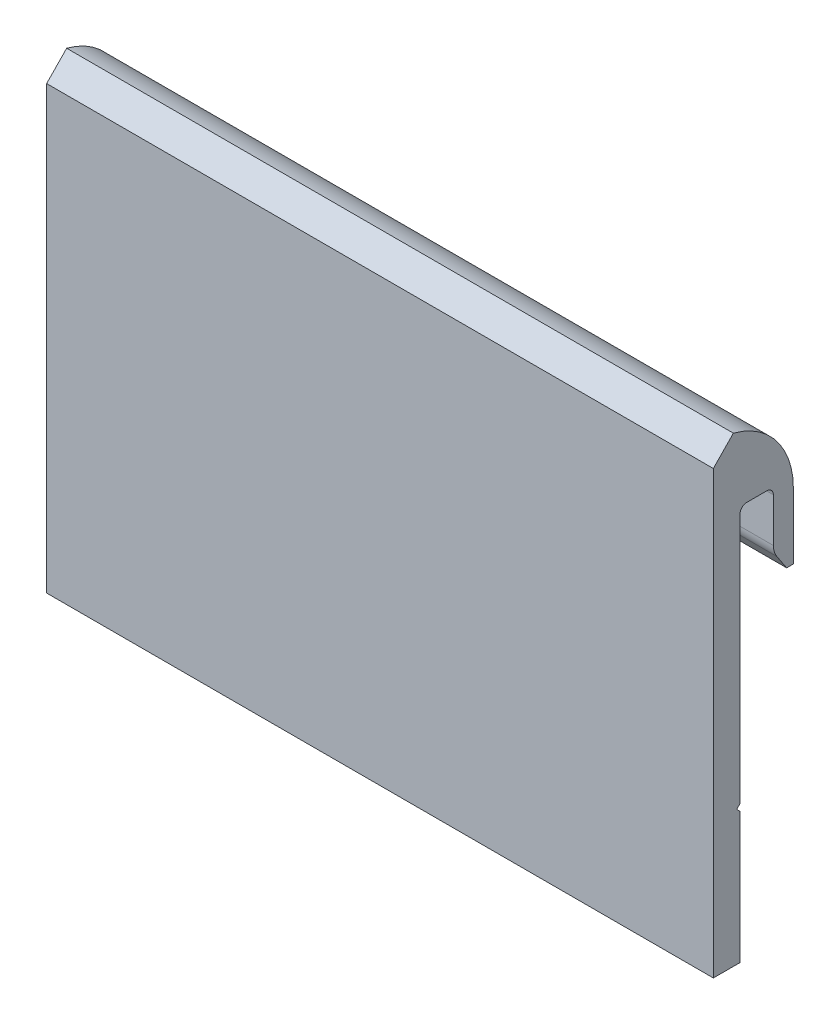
from build123d import *

# Parameters (mm, degrees)
EXTRUDE1_DEPTH = 50


with BuildPart() as part:
    # Sketch1 → Extrude1 (new, symmetric)
    with BuildSketch(Plane.ZY):
        with BuildLine():
            Line((-0.821931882, 64.020986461), (-4.821931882, 64.020986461))
            Line((-4.821931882, 64.020986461), (-4.821931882, 83.675116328))
            Line((-4.821931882, 83.675116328), (-4.321931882, 84.175116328))
            Line((-4.321931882, 84.175116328), (-4.821931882, 84.675116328))
            Line((-4.821931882, 84.675116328), (-4.821931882, 122.294066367))
            ThreePointArc((-4.821931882, 122.294066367), (-5.1148251, 123.001173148), (-5.821931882, 123.294066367))
            Line((-5.821931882, 123.294066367), (-8.821931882, 123.294066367))
            ThreePointArc((-8.821931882, 123.294066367), (-9.529038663, 123.001173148), (-9.821931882, 122.294066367))
            Line((-9.821931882, 122.294066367), (-9.821931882, 115.70239328))
            ThreePointArc((-9.821931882, 115.70239328), (-9.950655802, 114.833040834), (-10.325780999, 114.038292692))
            Line((-10.325780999, 114.038292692), (-11.821931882, 111.794066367))
            Line((-11.821931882, 111.794066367), (-12.821931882, 111.794066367))
            Line((-12.821931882, 111.794066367), (-12.821931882, 121.675116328))
            ThreePointArc((-12.821931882, 121.675116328), (-10.308764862, 129.023585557), (-3.821931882, 133.294066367))
            Line((-3.821931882, 133.294066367), (-0.821931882, 130.205977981))
            Line((-0.821931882, 130.205977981), (-0.821931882, 64.020986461))
        make_face()
    extrude(amount=EXTRUDE1_DEPTH, both=True)


solid = part.part
